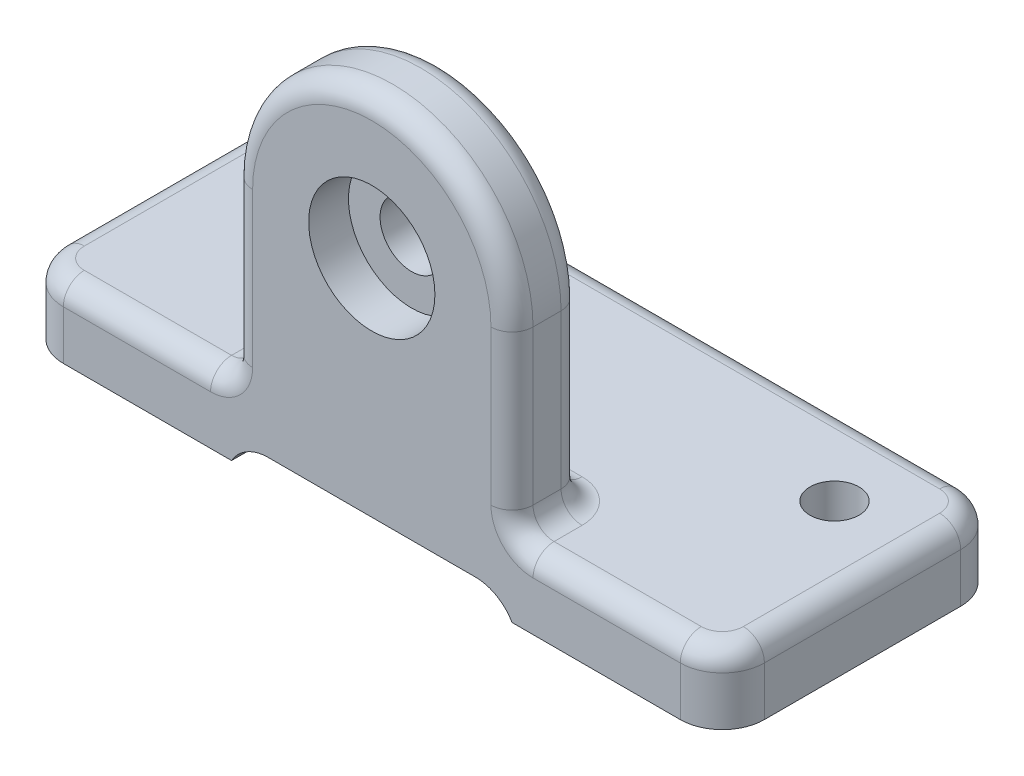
ISO-10303-21;
HEADER;
FILE_DESCRIPTION(('STEP AP214'),'2;1');
FILE_NAME('part.step','',(''),(''),'','','');
FILE_SCHEMA(('AUTOMOTIVE_DESIGN { 1 0 10303 214 1 1 1 1 }'));
ENDSEC;
DATA;
#1=APPLICATION_CONTEXT('core data for automotive mechanical design processes');
#2=APPLICATION_PROTOCOL_DEFINITION('international standard','automotive_design',2000,#1);
#3=PRODUCT_CONTEXT('',#1,'mechanical');
#4=PRODUCT('Part','Part','',(#3));
#5=PRODUCT_RELATED_PRODUCT_CATEGORY('part','',(#4));
#6=PRODUCT_DEFINITION_FORMATION('','',#4);
#7=PRODUCT_DEFINITION_CONTEXT('part definition',#1,'design');
#8=PRODUCT_DEFINITION('design','',#6,#7);
#9=PRODUCT_DEFINITION_SHAPE('','',#8);
#10=(LENGTH_UNIT() NAMED_UNIT(*) SI_UNIT(.MILLI.,.METRE.));
#11=(NAMED_UNIT(*) PLANE_ANGLE_UNIT() SI_UNIT($,.RADIAN.));
#12=(NAMED_UNIT(*) SI_UNIT($,.STERADIAN.) SOLID_ANGLE_UNIT());
#13=UNCERTAINTY_MEASURE_WITH_UNIT(LENGTH_MEASURE(1.E-05),#10,'distance_accuracy_value','');
#14=(GEOMETRIC_REPRESENTATION_CONTEXT(3) GLOBAL_UNCERTAINTY_ASSIGNED_CONTEXT((#13)) GLOBAL_UNIT_ASSIGNED_CONTEXT((#10,
#11,#12)) REPRESENTATION_CONTEXT('',''));
#15=CARTESIAN_POINT('',(0.,0.,0.));
#16=DIRECTION('',(0.,0.,1.));
#17=DIRECTION('',(1.,0.,0.));
#18=AXIS2_PLACEMENT_3D('',#15,#16,#17);
#19=CARTESIAN_POINT('',(0.,0.,-40.));
#20=DIRECTION('',(0.,-1.,0.));
#21=DIRECTION('',(0.,0.,-1.));
#22=AXIS2_PLACEMENT_3D('',#19,#20,#21);
#23=PLANE('',#22);
#24=CARTESIAN_POINT('',(12.,0.,-28.));
#25=DIRECTION('',(0.,1.,0.));
#26=DIRECTION('',(0.,0.,1.));
#27=AXIS2_PLACEMENT_3D('',#24,#25,#26);
#28=CIRCLE('',#27,3.5);
#29=CARTESIAN_POINT('',(12.,0.,-24.5));
#30=VERTEX_POINT('',#29);
#31=EDGE_CURVE('E489',#30,#30,#28,.T.);
#32=ORIENTED_EDGE('',*,*,#31,.T.);
#33=EDGE_LOOP('',(#32));
#34=FACE_BOUND('',#33,.T.);
#35=DIRECTION('',(1.,0.,0.));
#36=VECTOR('',#35,1.);
#37=CARTESIAN_POINT('',(0.,0.,0.));
#38=LINE('',#37,#36);
#39=CARTESIAN_POINT('',(6.,0.,0.));
#40=VERTEX_POINT('',#39);
#41=CARTESIAN_POINT('',(30.,0.,0.));
#42=VERTEX_POINT('',#41);
#43=EDGE_CURVE('E275',#40,#42,#38,.T.);
#44=ORIENTED_EDGE('',*,*,#43,.F.);
#45=CARTESIAN_POINT('',(6.,0.,-6.));
#46=DIRECTION('',(0.,-1.,0.));
#47=DIRECTION('',(0.,0.,-1.));
#48=AXIS2_PLACEMENT_3D('',#45,#46,#47);
#49=CIRCLE('',#48,6.);
#50=CARTESIAN_POINT('',(0.,0.,-6.));
#51=VERTEX_POINT('',#50);
#52=EDGE_CURVE('E292',#40,#51,#49,.T.);
#53=ORIENTED_EDGE('',*,*,#52,.T.);
#54=DIRECTION('',(0.,0.,1.));
#55=VECTOR('',#54,1.);
#56=CARTESIAN_POINT('',(0.,0.,0.));
#57=LINE('',#56,#55);
#58=CARTESIAN_POINT('',(0.,0.,-34.));
#59=VERTEX_POINT('',#58);
#60=EDGE_CURVE('E270',#59,#51,#57,.T.);
#61=ORIENTED_EDGE('',*,*,#60,.F.);
#62=CARTESIAN_POINT('',(6.,0.,-34.));
#63=DIRECTION('',(0.,-1.,0.));
#64=DIRECTION('',(0.,0.,-1.));
#65=AXIS2_PLACEMENT_3D('',#62,#63,#64);
#66=CIRCLE('',#65,6.);
#67=CARTESIAN_POINT('',(6.,0.,-40.));
#68=VERTEX_POINT('',#67);
#69=EDGE_CURVE('E248',#59,#68,#66,.T.);
#70=ORIENTED_EDGE('',*,*,#69,.T.);
#71=DIRECTION('',(-1.,0.,0.));
#72=VECTOR('',#71,1.);
#73=CARTESIAN_POINT('',(0.,0.,-40.));
#74=LINE('',#73,#72);
#75=CARTESIAN_POINT('',(30.,0.,-40.));
#76=VERTEX_POINT('',#75);
#77=EDGE_CURVE('E231',#76,#68,#74,.T.);
#78=ORIENTED_EDGE('',*,*,#77,.F.);
#79=DIRECTION('',(0.,0.,1.));
#80=VECTOR('',#79,1.);
#81=CARTESIAN_POINT('',(30.,0.,-40.));
#82=LINE('',#81,#80);
#83=EDGE_CURVE('E246',#76,#42,#82,.T.);
#84=ORIENTED_EDGE('',*,*,#83,.T.);
#85=EDGE_LOOP('',(#44,#53,#61,#70,#78,#84));
#86=FACE_BOUND('',#85,.T.);
#87=ADVANCED_FACE('F43',(#34,#86),#23,.T.);
#88=CARTESIAN_POINT('',(0.,10.,0.));
#89=DIRECTION('',(1.,0.,0.));
#90=DIRECTION('',(0.,0.,-1.));
#91=AXIS2_PLACEMENT_3D('',#88,#89,#90);
#92=PLANE('',#91);
#93=DIRECTION('',(0.,-1.,0.));
#94=VECTOR('',#93,1.);
#95=CARTESIAN_POINT('',(0.,10.,-6.));
#96=LINE('',#95,#94);
#97=CARTESIAN_POINT('',(0.,7.,-6.));
#98=VERTEX_POINT('',#97);
#99=EDGE_CURVE('E298',#51,#98,#96,.F.);
#100=ORIENTED_EDGE('',*,*,#99,.T.);
#101=DIRECTION('',(0.,0.,1.));
#102=VECTOR('',#101,1.);
#103=CARTESIAN_POINT('',(0.,7.,0.));
#104=LINE('',#103,#102);
#105=CARTESIAN_POINT('',(0.,7.,-34.));
#106=VERTEX_POINT('',#105);
#107=EDGE_CURVE('E346',#98,#106,#104,.F.);
#108=ORIENTED_EDGE('',*,*,#107,.T.);
#109=DIRECTION('',(0.,-1.,0.));
#110=VECTOR('',#109,1.);
#111=CARTESIAN_POINT('',(0.,10.,-34.));
#112=LINE('',#111,#110);
#113=EDGE_CURVE('E295',#106,#59,#112,.T.);
#114=ORIENTED_EDGE('',*,*,#113,.T.);
#115=ORIENTED_EDGE('',*,*,#60,.T.);
#116=EDGE_LOOP('',(#100,#108,#114,#115));
#117=FACE_BOUND('',#116,.T.);
#118=ADVANCED_FACE('F506',(#117),#92,.F.);
#119=CARTESIAN_POINT('',(0.,10.,0.));
#120=DIRECTION('',(0.,0.,-1.));
#121=DIRECTION('',(-1.,0.,0.));
#122=AXIS2_PLACEMENT_3D('',#119,#120,#121);
#123=PLANE('',#122);
#124=CARTESIAN_POINT('',(50.,35.,0.));
#125=DIRECTION('',(0.,0.,1.));
#126=DIRECTION('',(1.,0.,0.));
#127=AXIS2_PLACEMENT_3D('',#124,#125,#126);
#128=CIRCLE('',#127,9.005);
#129=CARTESIAN_POINT('',(59.005,35.,0.));
#130=VERTEX_POINT('',#129);
#131=EDGE_CURVE('E282',#130,#130,#128,.T.);
#132=ORIENTED_EDGE('',*,*,#131,.F.);
#133=EDGE_LOOP('',(#132));
#134=FACE_BOUND('',#133,.T.);
#135=CARTESIAN_POINT('',(27.,13.,0.));
#136=DIRECTION('',(0.,0.,-1.));
#137=DIRECTION('',(-1.,0.,0.));
#138=AXIS2_PLACEMENT_3D('',#135,#136,#137);
#139=CIRCLE('',#138,6.);
#140=CARTESIAN_POINT('',(27.,7.,0.));
#141=VERTEX_POINT('',#140);
#142=CARTESIAN_POINT('',(33.,13.,0.));
#143=VERTEX_POINT('',#142);
#144=EDGE_CURVE('E367',#141,#143,#139,.F.);
#145=ORIENTED_EDGE('',*,*,#144,.F.);
#146=DIRECTION('',(1.,0.,0.));
#147=VECTOR('',#146,1.);
#148=CARTESIAN_POINT('',(0.,7.,0.));
#149=LINE('',#148,#147);
#150=CARTESIAN_POINT('',(6.,7.,0.));
#151=VERTEX_POINT('',#150);
#152=EDGE_CURVE('E375',#141,#151,#149,.F.);
#153=ORIENTED_EDGE('',*,*,#152,.T.);
#154=DIRECTION('',(0.,-1.,0.));
#155=VECTOR('',#154,1.);
#156=CARTESIAN_POINT('',(6.,10.,0.));
#157=LINE('',#156,#155);
#158=EDGE_CURVE('E286',#151,#40,#157,.T.);
#159=ORIENTED_EDGE('',*,*,#158,.T.);
#160=ORIENTED_EDGE('',*,*,#43,.T.);
#161=CARTESIAN_POINT('',(35.1961524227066,-3.,0.));
#162=DIRECTION('',(0.,0.,-1.));
#163=DIRECTION('',(-1.,0.,0.));
#164=AXIS2_PLACEMENT_3D('',#161,#162,#163);
#165=CIRCLE('',#164,6.);
#166=CARTESIAN_POINT('',(35.1961524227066,3.,0.));
#167=VERTEX_POINT('',#166);
#168=EDGE_CURVE('E241',#42,#167,#165,.T.);
#169=ORIENTED_EDGE('',*,*,#168,.T.);
#170=DIRECTION('',(-1.,0.,0.));
#171=VECTOR('',#170,1.);
#172=CARTESIAN_POINT('',(30.,3.,0.));
#173=LINE('',#172,#171);
#174=CARTESIAN_POINT('',(64.8038475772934,3.,0.));
#175=VERTEX_POINT('',#174);
#176=EDGE_CURVE('E257',#175,#167,#173,.T.);
#177=ORIENTED_EDGE('',*,*,#176,.F.);
#178=CARTESIAN_POINT('',(64.8038475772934,-3.,0.));
#179=DIRECTION('',(0.,0.,-1.));
#180=DIRECTION('',(-1.,0.,0.));
#181=AXIS2_PLACEMENT_3D('',#178,#179,#180);
#182=CIRCLE('',#181,6.);
#183=CARTESIAN_POINT('',(70.,0.,0.));
#184=VERTEX_POINT('',#183);
#185=EDGE_CURVE('E315',#175,#184,#182,.T.);
#186=ORIENTED_EDGE('',*,*,#185,.T.);
#187=CARTESIAN_POINT('',(94.,0.,0.));
#188=VERTEX_POINT('',#187);
#189=EDGE_CURVE('E272',#184,#188,#38,.T.);
#190=ORIENTED_EDGE('',*,*,#189,.T.);
#191=DIRECTION('',(0.,-1.,0.));
#192=VECTOR('',#191,1.);
#193=CARTESIAN_POINT('',(94.,10.,0.));
#194=LINE('',#193,#192);
#195=CARTESIAN_POINT('',(94.,7.,0.));
#196=VERTEX_POINT('',#195);
#197=EDGE_CURVE('E287',#188,#196,#194,.F.);
#198=ORIENTED_EDGE('',*,*,#197,.T.);
#199=DIRECTION('',(1.,0.,0.));
#200=VECTOR('',#199,1.);
#201=CARTESIAN_POINT('',(0.,7.,0.));
#202=LINE('',#201,#200);
#203=CARTESIAN_POINT('',(73.,7.,0.));
#204=VERTEX_POINT('',#203);
#205=EDGE_CURVE('E370',#196,#204,#202,.F.);
#206=ORIENTED_EDGE('',*,*,#205,.T.);
#207=CARTESIAN_POINT('',(73.,13.,0.));
#208=DIRECTION('',(0.,0.,-1.));
#209=DIRECTION('',(-1.,0.,0.));
#210=AXIS2_PLACEMENT_3D('',#207,#208,#209);
#211=CIRCLE('',#210,6.);
#212=CARTESIAN_POINT('',(67.,13.,0.));
#213=VERTEX_POINT('',#212);
#214=EDGE_CURVE('E364',#213,#204,#211,.F.);
#215=ORIENTED_EDGE('',*,*,#214,.F.);
#216=DIRECTION('',(0.,1.,0.));
#217=VECTOR('',#216,1.);
#218=CARTESIAN_POINT('',(67.,35.,0.));
#219=LINE('',#218,#217);
#220=CARTESIAN_POINT('',(67.,35.,0.));
#221=VERTEX_POINT('',#220);
#222=EDGE_CURVE('E365',#213,#221,#219,.T.);
#223=ORIENTED_EDGE('',*,*,#222,.T.);
#224=CARTESIAN_POINT('',(50.,35.,0.));
#225=DIRECTION('',(0.,0.,-1.));
#226=DIRECTION('',(-1.,0.,0.));
#227=AXIS2_PLACEMENT_3D('',#224,#225,#226);
#228=CIRCLE('',#227,17.);
#229=CARTESIAN_POINT('',(33.,35.,0.));
#230=VERTEX_POINT('',#229);
#231=EDGE_CURVE('E356',#221,#230,#228,.F.);
#232=ORIENTED_EDGE('',*,*,#231,.T.);
#233=DIRECTION('',(0.,-1.,0.));
#234=VECTOR('',#233,1.);
#235=CARTESIAN_POINT('',(33.,10.,0.));
#236=LINE('',#235,#234);
#237=EDGE_CURVE('E359',#230,#143,#236,.T.);
#238=ORIENTED_EDGE('',*,*,#237,.T.);
#239=EDGE_LOOP('',(#145,#153,#159,#160,#169,#177,#186,#190,#198,#206,#215,#223,#232,#238));
#240=FACE_BOUND('',#239,.T.);
#241=ADVANCED_FACE('F498',(#134,#240),#123,.F.);
#242=CARTESIAN_POINT('',(100.,10.,0.));
#243=DIRECTION('',(-1.,0.,0.));
#244=DIRECTION('',(0.,0.,1.));
#245=AXIS2_PLACEMENT_3D('',#242,#243,#244);
#246=PLANE('',#245);
#247=DIRECTION('',(0.,-1.,0.));
#248=VECTOR('',#247,1.);
#249=CARTESIAN_POINT('',(100.,10.,-34.));
#250=LINE('',#249,#248);
#251=CARTESIAN_POINT('',(100.,0.,-34.));
#252=VERTEX_POINT('',#251);
#253=CARTESIAN_POINT('',(100.,7.,-34.));
#254=VERTEX_POINT('',#253);
#255=EDGE_CURVE('E307',#252,#254,#250,.F.);
#256=ORIENTED_EDGE('',*,*,#255,.T.);
#257=DIRECTION('',(0.,0.,-1.));
#258=VECTOR('',#257,1.);
#259=CARTESIAN_POINT('',(100.,7.,0.));
#260=LINE('',#259,#258);
#261=CARTESIAN_POINT('',(100.,7.,-6.));
#262=VERTEX_POINT('',#261);
#263=EDGE_CURVE('E372',#254,#262,#260,.F.);
#264=ORIENTED_EDGE('',*,*,#263,.T.);
#265=DIRECTION('',(0.,-1.,0.));
#266=VECTOR('',#265,1.);
#267=CARTESIAN_POINT('',(100.,10.,-6.));
#268=LINE('',#267,#266);
#269=CARTESIAN_POINT('',(100.,0.,-6.));
#270=VERTEX_POINT('',#269);
#271=EDGE_CURVE('E310',#262,#270,#268,.T.);
#272=ORIENTED_EDGE('',*,*,#271,.T.);
#273=DIRECTION('',(0.,0.,-1.));
#274=VECTOR('',#273,1.);
#275=CARTESIAN_POINT('',(100.,0.,0.));
#276=LINE('',#275,#274);
#277=EDGE_CURVE('E252',#270,#252,#276,.T.);
#278=ORIENTED_EDGE('',*,*,#277,.T.);
#279=EDGE_LOOP('',(#256,#264,#272,#278));
#280=FACE_BOUND('',#279,.T.);
#281=ADVANCED_FACE('F548',(#280),#246,.F.);
#282=CARTESIAN_POINT('',(0.,10.,-40.));
#283=DIRECTION('',(0.,0.,1.));
#284=DIRECTION('',(1.,0.,0.));
#285=AXIS2_PLACEMENT_3D('',#282,#283,#284);
#286=PLANE('',#285);
#287=DIRECTION('',(0.,-1.,0.));
#288=VECTOR('',#287,1.);
#289=CARTESIAN_POINT('',(6.,10.,-40.));
#290=LINE('',#289,#288);
#291=CARTESIAN_POINT('',(6.,7.,-40.));
#292=VERTEX_POINT('',#291);
#293=EDGE_CURVE('E301',#68,#292,#290,.F.);
#294=ORIENTED_EDGE('',*,*,#293,.T.);
#295=DIRECTION('',(-1.,0.,0.));
#296=VECTOR('',#295,1.);
#297=CARTESIAN_POINT('',(0.,7.,-40.));
#298=LINE('',#297,#296);
#299=CARTESIAN_POINT('',(94.,7.,-40.));
#300=VERTEX_POINT('',#299);
#301=EDGE_CURVE('E354',#292,#300,#298,.F.);
#302=ORIENTED_EDGE('',*,*,#301,.T.);
#303=DIRECTION('',(0.,-1.,0.));
#304=VECTOR('',#303,1.);
#305=CARTESIAN_POINT('',(94.,10.,-40.));
#306=LINE('',#305,#304);
#307=CARTESIAN_POINT('',(94.,0.,-40.));
#308=VERTEX_POINT('',#307);
#309=EDGE_CURVE('E299',#300,#308,#306,.T.);
#310=ORIENTED_EDGE('',*,*,#309,.T.);
#311=CARTESIAN_POINT('',(70.,0.,-40.));
#312=VERTEX_POINT('',#311);
#313=EDGE_CURVE('E249',#308,#312,#74,.T.);
#314=ORIENTED_EDGE('',*,*,#313,.T.);
#315=CARTESIAN_POINT('',(64.8038475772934,-3.,-40.));
#316=DIRECTION('',(0.,0.,1.));
#317=DIRECTION('',(1.,0.,0.));
#318=AXIS2_PLACEMENT_3D('',#315,#316,#317);
#319=CIRCLE('',#318,6.);
#320=CARTESIAN_POINT('',(64.8038475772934,3.,-40.));
#321=VERTEX_POINT('',#320);
#322=EDGE_CURVE('E313',#312,#321,#319,.T.);
#323=ORIENTED_EDGE('',*,*,#322,.T.);
#324=DIRECTION('',(-1.,0.,0.));
#325=VECTOR('',#324,1.);
#326=CARTESIAN_POINT('',(30.,3.,-40.));
#327=LINE('',#326,#325);
#328=CARTESIAN_POINT('',(35.1961524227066,3.,-40.));
#329=VERTEX_POINT('',#328);
#330=EDGE_CURVE('E236',#321,#329,#327,.T.);
#331=ORIENTED_EDGE('',*,*,#330,.T.);
#332=CARTESIAN_POINT('',(35.1961524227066,-3.,-40.));
#333=DIRECTION('',(0.,0.,1.));
#334=DIRECTION('',(1.,0.,0.));
#335=AXIS2_PLACEMENT_3D('',#332,#333,#334);
#336=CIRCLE('',#335,6.);
#337=EDGE_CURVE('E230',#329,#76,#336,.T.);
#338=ORIENTED_EDGE('',*,*,#337,.T.);
#339=ORIENTED_EDGE('',*,*,#77,.T.);
#340=EDGE_LOOP('',(#294,#302,#310,#314,#323,#331,#338,#339));
#341=FACE_BOUND('',#340,.T.);
#342=ADVANCED_FACE('F235',(#341),#286,.F.);
#343=CARTESIAN_POINT('',(0.,10.,-40.));
#344=DIRECTION('',(0.,-1.,0.));
#345=DIRECTION('',(0.,0.,-1.));
#346=AXIS2_PLACEMENT_3D('',#343,#344,#345);
#347=PLANE('',#346);
#348=DIRECTION('',(-1.,0.,0.));
#349=VECTOR('',#348,1.);
#350=CARTESIAN_POINT('',(0.,10.,-37.));
#351=LINE('',#350,#349);
#352=CARTESIAN_POINT('',(94.,10.,-37.));
#353=VERTEX_POINT('',#352);
#354=CARTESIAN_POINT('',(6.,10.,-37.));
#355=VERTEX_POINT('',#354);
#356=EDGE_CURVE('E338',#353,#355,#351,.T.);
#357=ORIENTED_EDGE('',*,*,#356,.T.);
#358=CARTESIAN_POINT('',(6.,10.,-34.));
#359=DIRECTION('',(0.,-1.,0.));
#360=DIRECTION('',(0.,0.,-1.));
#361=AXIS2_PLACEMENT_3D('',#358,#359,#360);
#362=CIRCLE('',#361,3.);
#363=CARTESIAN_POINT('',(3.,10.,-34.));
#364=VERTEX_POINT('',#363);
#365=EDGE_CURVE('E341',#355,#364,#362,.F.);
#366=ORIENTED_EDGE('',*,*,#365,.T.);
#367=DIRECTION('',(0.,0.,1.));
#368=VECTOR('',#367,1.);
#369=CARTESIAN_POINT('',(3.,10.,-40.));
#370=LINE('',#369,#368);
#371=CARTESIAN_POINT('',(3.,10.,-6.));
#372=VERTEX_POINT('',#371);
#373=EDGE_CURVE('E345',#364,#372,#370,.T.);
#374=ORIENTED_EDGE('',*,*,#373,.T.);
#375=CARTESIAN_POINT('',(6.,10.,-6.));
#376=DIRECTION('',(0.,-1.,0.));
#377=DIRECTION('',(0.,0.,-1.));
#378=AXIS2_PLACEMENT_3D('',#375,#376,#377);
#379=CIRCLE('',#378,3.);
#380=CARTESIAN_POINT('',(6.,10.,-3.));
#381=VERTEX_POINT('',#380);
#382=EDGE_CURVE('E336',#372,#381,#379,.F.);
#383=ORIENTED_EDGE('',*,*,#382,.T.);
#384=DIRECTION('',(1.,0.,0.));
#385=VECTOR('',#384,1.);
#386=CARTESIAN_POINT('',(0.,10.,-3.));
#387=LINE('',#386,#385);
#388=CARTESIAN_POINT('',(27.,10.,-3.));
#389=VERTEX_POINT('',#388);
#390=EDGE_CURVE('E331',#381,#389,#387,.T.);
#391=ORIENTED_EDGE('',*,*,#390,.T.);
#392=DIRECTION('',(0.,0.,-1.));
#393=VECTOR('',#392,1.);
#394=CARTESIAN_POINT('',(27.,10.,-40.));
#395=LINE('',#394,#393);
#396=CARTESIAN_POINT('',(27.,10.,-7.));
#397=VERTEX_POINT('',#396);
#398=EDGE_CURVE('E328',#389,#397,#395,.T.);
#399=ORIENTED_EDGE('',*,*,#398,.T.);
#400=CARTESIAN_POINT('',(33.,10.,-7.));
#401=DIRECTION('',(0.,-1.,0.));
#402=DIRECTION('',(0.,0.,-1.));
#403=AXIS2_PLACEMENT_3D('',#400,#401,#402);
#404=CIRCLE('',#403,6.);
#405=CARTESIAN_POINT('',(33.,10.,-13.));
#406=VERTEX_POINT('',#405);
#407=EDGE_CURVE('E330',#406,#397,#404,.F.);
#408=ORIENTED_EDGE('',*,*,#407,.F.);
#409=DIRECTION('',(1.,0.,0.));
#410=VECTOR('',#409,1.);
#411=CARTESIAN_POINT('',(0.,10.,-13.));
#412=LINE('',#411,#410);
#413=CARTESIAN_POINT('',(67.,10.,-13.));
#414=VERTEX_POINT('',#413);
#415=EDGE_CURVE('E325',#406,#414,#412,.T.);
#416=ORIENTED_EDGE('',*,*,#415,.T.);
#417=CARTESIAN_POINT('',(67.,10.,-7.));
#418=DIRECTION('',(0.,-1.,0.));
#419=DIRECTION('',(0.,0.,-1.));
#420=AXIS2_PLACEMENT_3D('',#417,#418,#419);
#421=CIRCLE('',#420,6.);
#422=CARTESIAN_POINT('',(73.,10.,-7.));
#423=VERTEX_POINT('',#422);
#424=EDGE_CURVE('E318',#423,#414,#421,.F.);
#425=ORIENTED_EDGE('',*,*,#424,.F.);
#426=DIRECTION('',(0.,0.,1.));
#427=VECTOR('',#426,1.);
#428=CARTESIAN_POINT('',(73.,10.,-40.));
#429=LINE('',#428,#427);
#430=CARTESIAN_POINT('',(73.,10.,-3.));
#431=VERTEX_POINT('',#430);
#432=EDGE_CURVE('E239',#423,#431,#429,.T.);
#433=ORIENTED_EDGE('',*,*,#432,.T.);
#434=DIRECTION('',(1.,0.,0.));
#435=VECTOR('',#434,1.);
#436=CARTESIAN_POINT('',(0.,10.,-3.));
#437=LINE('',#436,#435);
#438=CARTESIAN_POINT('',(94.,10.,-3.));
#439=VERTEX_POINT('',#438);
#440=EDGE_CURVE('E319',#431,#439,#437,.T.);
#441=ORIENTED_EDGE('',*,*,#440,.T.);
#442=CARTESIAN_POINT('',(94.,10.,-6.));
#443=DIRECTION('',(0.,-1.,0.));
#444=DIRECTION('',(0.,0.,-1.));
#445=AXIS2_PLACEMENT_3D('',#442,#443,#444);
#446=CIRCLE('',#445,3.);
#447=CARTESIAN_POINT('',(97.,10.,-6.));
#448=VERTEX_POINT('',#447);
#449=EDGE_CURVE('E322',#439,#448,#446,.F.);
#450=ORIENTED_EDGE('',*,*,#449,.T.);
#451=DIRECTION('',(0.,0.,-1.));
#452=VECTOR('',#451,1.);
#453=CARTESIAN_POINT('',(97.,10.,-40.));
#454=LINE('',#453,#452);
#455=CARTESIAN_POINT('',(97.,10.,-34.));
#456=VERTEX_POINT('',#455);
#457=EDGE_CURVE('E335',#448,#456,#454,.T.);
#458=ORIENTED_EDGE('',*,*,#457,.T.);
#459=CARTESIAN_POINT('',(94.,10.,-34.));
#460=DIRECTION('',(0.,-1.,0.));
#461=DIRECTION('',(0.,0.,-1.));
#462=AXIS2_PLACEMENT_3D('',#459,#460,#461);
#463=CIRCLE('',#462,3.);
#464=EDGE_CURVE('E337',#456,#353,#463,.F.);
#465=ORIENTED_EDGE('',*,*,#464,.T.);
#466=EDGE_LOOP('',(#357,#366,#374,#383,#391,#399,#408,#416,#425,#433,#441,#450,#458,#465));
#467=FACE_BOUND('',#466,.T.);
#468=CARTESIAN_POINT('',(88.,10.,-28.));
#469=DIRECTION('',(0.,1.,0.));
#470=DIRECTION('',(0.,0.,1.));
#471=AXIS2_PLACEMENT_3D('',#468,#469,#470);
#472=CIRCLE('',#471,3.49999999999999);
#473=CARTESIAN_POINT('',(88.,10.,-24.5));
#474=VERTEX_POINT('',#473);
#475=EDGE_CURVE('E278',#474,#474,#472,.T.);
#476=ORIENTED_EDGE('',*,*,#475,.F.);
#477=EDGE_LOOP('',(#476));
#478=FACE_BOUND('',#477,.T.);
#479=CARTESIAN_POINT('',(12.,10.,-28.));
#480=DIRECTION('',(0.,1.,0.));
#481=DIRECTION('',(0.,0.,1.));
#482=AXIS2_PLACEMENT_3D('',#479,#480,#481);
#483=CIRCLE('',#482,3.49999999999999);
#484=CARTESIAN_POINT('',(12.,10.,-24.5));
#485=VERTEX_POINT('',#484);
#486=EDGE_CURVE('E487',#485,#485,#483,.T.);
#487=ORIENTED_EDGE('',*,*,#486,.F.);
#488=EDGE_LOOP('',(#487));
#489=FACE_BOUND('',#488,.T.);
#490=ADVANCED_FACE('F591',(#467,#478,#489),#347,.F.);
#491=CARTESIAN_POINT('',(88.,0.,-28.));
#492=DIRECTION('',(0.,1.,0.));
#493=DIRECTION('',(0.,0.,1.));
#494=AXIS2_PLACEMENT_3D('',#491,#492,#493);
#495=CIRCLE('',#494,3.5);
#496=CARTESIAN_POINT('',(88.,0.,-24.5));
#497=VERTEX_POINT('',#496);
#498=EDGE_CURVE('E481',#497,#497,#495,.T.);
#499=ORIENTED_EDGE('',*,*,#498,.T.);
#500=EDGE_LOOP('',(#499));
#501=FACE_BOUND('',#500,.T.);
#502=ORIENTED_EDGE('',*,*,#313,.F.);
#503=CARTESIAN_POINT('',(94.,0.,-34.));
#504=DIRECTION('',(0.,-1.,0.));
#505=DIRECTION('',(0.,0.,-1.));
#506=AXIS2_PLACEMENT_3D('',#503,#504,#505);
#507=CIRCLE('',#506,6.);
#508=EDGE_CURVE('E304',#308,#252,#507,.T.);
#509=ORIENTED_EDGE('',*,*,#508,.T.);
#510=ORIENTED_EDGE('',*,*,#277,.F.);
#511=CARTESIAN_POINT('',(94.,0.,-6.));
#512=DIRECTION('',(0.,-1.,0.));
#513=DIRECTION('',(0.,0.,-1.));
#514=AXIS2_PLACEMENT_3D('',#511,#512,#513);
#515=CIRCLE('',#514,6.);
#516=EDGE_CURVE('E303',#270,#188,#515,.T.);
#517=ORIENTED_EDGE('',*,*,#516,.T.);
#518=ORIENTED_EDGE('',*,*,#189,.F.);
#519=DIRECTION('',(0.,0.,1.));
#520=VECTOR('',#519,1.);
#521=CARTESIAN_POINT('',(70.,0.,-40.));
#522=LINE('',#521,#520);
#523=EDGE_CURVE('E253',#312,#184,#522,.T.);
#524=ORIENTED_EDGE('',*,*,#523,.F.);
#525=EDGE_LOOP('',(#502,#509,#510,#517,#518,#524));
#526=FACE_BOUND('',#525,.T.);
#527=ADVANCED_FACE('F626',(#501,#526),#23,.T.);
#528=CARTESIAN_POINT('',(30.,0.,-10.));
#529=DIRECTION('',(-1.,0.,0.));
#530=DIRECTION('',(0.,-1.,0.));
#531=AXIS2_PLACEMENT_3D('',#528,#529,#530);
#532=PLANE('',#531);
#533=DIRECTION('',(0.,0.,1.));
#534=VECTOR('',#533,1.);
#535=CARTESIAN_POINT('',(30.,35.,-10.));
#536=LINE('',#535,#534);
#537=CARTESIAN_POINT('',(30.,35.,-7.));
#538=VERTEX_POINT('',#537);
#539=CARTESIAN_POINT('',(30.,35.,-3.));
#540=VERTEX_POINT('',#539);
#541=EDGE_CURVE('E261',#538,#540,#536,.T.);
#542=ORIENTED_EDGE('',*,*,#541,.F.);
#543=DIRECTION('',(0.,-1.,0.));
#544=VECTOR('',#543,1.);
#545=CARTESIAN_POINT('',(30.,0.,-7.));
#546=LINE('',#545,#544);
#547=CARTESIAN_POINT('',(30.,13.,-7.));
#548=VERTEX_POINT('',#547);
#549=EDGE_CURVE('E382',#538,#548,#546,.T.);
#550=ORIENTED_EDGE('',*,*,#549,.T.);
#551=DIRECTION('',(0.,0.,-1.));
#552=VECTOR('',#551,1.);
#553=CARTESIAN_POINT('',(30.,13.,-10.));
#554=LINE('',#553,#552);
#555=CARTESIAN_POINT('',(30.,13.,-3.));
#556=VERTEX_POINT('',#555);
#557=EDGE_CURVE('E377',#548,#556,#554,.F.);
#558=ORIENTED_EDGE('',*,*,#557,.T.);
#559=DIRECTION('',(0.,-1.,0.));
#560=VECTOR('',#559,1.);
#561=CARTESIAN_POINT('',(30.,35.,-3.));
#562=LINE('',#561,#560);
#563=EDGE_CURVE('E376',#556,#540,#562,.F.);
#564=ORIENTED_EDGE('',*,*,#563,.T.);
#565=EDGE_LOOP('',(#542,#550,#558,#564));
#566=FACE_BOUND('',#565,.T.);
#567=ADVANCED_FACE('F634',(#566),#532,.T.);
#568=CARTESIAN_POINT('',(70.,35.,-10.));
#569=DIRECTION('',(1.,0.,0.));
#570=DIRECTION('',(0.,0.,-1.));
#571=AXIS2_PLACEMENT_3D('',#568,#569,#570);
#572=PLANE('',#571);
#573=DIRECTION('',(0.,0.,1.));
#574=VECTOR('',#573,1.);
#575=CARTESIAN_POINT('',(70.,13.,-10.));
#576=LINE('',#575,#574);
#577=CARTESIAN_POINT('',(70.,13.,-3.));
#578=VERTEX_POINT('',#577);
#579=CARTESIAN_POINT('',(70.,13.,-7.));
#580=VERTEX_POINT('',#579);
#581=EDGE_CURVE('E58',#578,#580,#576,.F.);
#582=ORIENTED_EDGE('',*,*,#581,.T.);
#583=DIRECTION('',(0.,1.,0.));
#584=VECTOR('',#583,1.);
#585=CARTESIAN_POINT('',(70.,35.,-7.));
#586=LINE('',#585,#584);
#587=CARTESIAN_POINT('',(70.,35.,-7.));
#588=VERTEX_POINT('',#587);
#589=EDGE_CURVE('E397',#580,#588,#586,.T.);
#590=ORIENTED_EDGE('',*,*,#589,.T.);
#591=DIRECTION('',(0.,0.,1.));
#592=VECTOR('',#591,1.);
#593=CARTESIAN_POINT('',(70.,35.,-10.));
#594=LINE('',#593,#592);
#595=CARTESIAN_POINT('',(70.,35.,-3.));
#596=VERTEX_POINT('',#595);
#597=EDGE_CURVE('E260',#588,#596,#594,.T.);
#598=ORIENTED_EDGE('',*,*,#597,.T.);
#599=DIRECTION('',(0.,1.,0.));
#600=VECTOR('',#599,1.);
#601=CARTESIAN_POINT('',(70.,10.,-3.));
#602=LINE('',#601,#600);
#603=EDGE_CURVE('E62',#596,#578,#602,.F.);
#604=ORIENTED_EDGE('',*,*,#603,.T.);
#605=EDGE_LOOP('',(#582,#590,#598,#604));
#606=FACE_BOUND('',#605,.T.);
#607=ADVANCED_FACE('F642',(#606),#572,.T.);
#608=CARTESIAN_POINT('',(50.,35.,-10.));
#609=DIRECTION('',(0.,0.,-1.));
#610=DIRECTION('',(-1.,0.,0.));
#611=AXIS2_PLACEMENT_3D('',#608,#609,#610);
#612=PLANE('',#611);
#613=DIRECTION('',(0.,1.,0.));
#614=VECTOR('',#613,1.);
#615=CARTESIAN_POINT('',(67.,35.,-10.));
#616=LINE('',#615,#614);
#617=CARTESIAN_POINT('',(67.,35.,-10.));
#618=VERTEX_POINT('',#617);
#619=CARTESIAN_POINT('',(67.,13.,-10.));
#620=VERTEX_POINT('',#619);
#621=EDGE_CURVE('E388',#618,#620,#616,.F.);
#622=ORIENTED_EDGE('',*,*,#621,.T.);
#623=DIRECTION('',(1.,0.,0.));
#624=VECTOR('',#623,1.);
#625=CARTESIAN_POINT('',(50.,13.,-10.));
#626=LINE('',#625,#624);
#627=CARTESIAN_POINT('',(33.,13.,-10.));
#628=VERTEX_POINT('',#627);
#629=EDGE_CURVE('E392',#620,#628,#626,.F.);
#630=ORIENTED_EDGE('',*,*,#629,.T.);
#631=DIRECTION('',(0.,-1.,0.));
#632=VECTOR('',#631,1.);
#633=CARTESIAN_POINT('',(33.,35.,-10.));
#634=LINE('',#633,#632);
#635=CARTESIAN_POINT('',(33.,35.,-10.));
#636=VERTEX_POINT('',#635);
#637=EDGE_CURVE('E386',#628,#636,#634,.F.);
#638=ORIENTED_EDGE('',*,*,#637,.T.);
#639=CARTESIAN_POINT('',(50.,35.,-10.));
#640=DIRECTION('',(0.,0.,-1.));
#641=DIRECTION('',(-1.,0.,0.));
#642=AXIS2_PLACEMENT_3D('',#639,#640,#641);
#643=CIRCLE('',#642,17.);
#644=EDGE_CURVE('E383',#636,#618,#643,.T.);
#645=ORIENTED_EDGE('',*,*,#644,.T.);
#646=EDGE_LOOP('',(#622,#630,#638,#645));
#647=FACE_BOUND('',#646,.T.);
#648=CARTESIAN_POINT('',(50.,35.,-10.));
#649=DIRECTION('',(0.,0.,-1.));
#650=DIRECTION('',(-1.,0.,0.));
#651=AXIS2_PLACEMENT_3D('',#648,#649,#650);
#652=CIRCLE('',#651,4.5);
#653=CARTESIAN_POINT('',(45.5,35.,-10.));
#654=VERTEX_POINT('',#653);
#655=EDGE_CURVE('E280',#654,#654,#652,.T.);
#656=ORIENTED_EDGE('',*,*,#655,.F.);
#657=EDGE_LOOP('',(#656));
#658=FACE_BOUND('',#657,.T.);
#659=ADVANCED_FACE('F714',(#647,#658),#612,.T.);
#660=CARTESIAN_POINT('',(50.,35.,-10.));
#661=DIRECTION('',(0.,0.,1.));
#662=DIRECTION('',(1.,0.,0.));
#663=AXIS2_PLACEMENT_3D('',#660,#661,#662);
#664=CYLINDRICAL_SURFACE('',#663,20.);
#665=ORIENTED_EDGE('',*,*,#597,.F.);
#666=CARTESIAN_POINT('',(50.,35.,-7.));
#667=DIRECTION('',(0.,0.,-1.));
#668=DIRECTION('',(-1.,0.,0.));
#669=AXIS2_PLACEMENT_3D('',#666,#667,#668);
#670=CIRCLE('',#669,20.);
#671=EDGE_CURVE('E11',#588,#538,#670,.F.);
#672=ORIENTED_EDGE('',*,*,#671,.T.);
#673=ORIENTED_EDGE('',*,*,#541,.T.);
#674=CARTESIAN_POINT('',(50.,35.,-3.));
#675=DIRECTION('',(0.,0.,-1.));
#676=DIRECTION('',(-1.,0.,0.));
#677=AXIS2_PLACEMENT_3D('',#674,#675,#676);
#678=CIRCLE('',#677,20.);
#679=EDGE_CURVE('E55',#540,#596,#678,.T.);
#680=ORIENTED_EDGE('',*,*,#679,.T.);
#681=EDGE_LOOP('',(#665,#672,#673,#680));
#682=FACE_BOUND('',#681,.T.);
#683=ADVANCED_FACE('F717',(#682),#664,.T.);
#684=CARTESIAN_POINT('',(30.,3.,-40.));
#685=DIRECTION('',(0.,1.,0.));
#686=DIRECTION('',(0.,0.,1.));
#687=AXIS2_PLACEMENT_3D('',#684,#685,#686);
#688=PLANE('',#687);
#689=ORIENTED_EDGE('',*,*,#330,.F.);
#690=DIRECTION('',(0.,0.,-1.));
#691=VECTOR('',#690,1.);
#692=CARTESIAN_POINT('',(64.8038475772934,3.,-40.));
#693=LINE('',#692,#691);
#694=EDGE_CURVE('E283',#321,#175,#693,.F.);
#695=ORIENTED_EDGE('',*,*,#694,.T.);
#696=ORIENTED_EDGE('',*,*,#176,.T.);
#697=DIRECTION('',(0.,0.,1.));
#698=VECTOR('',#697,1.);
#699=CARTESIAN_POINT('',(35.1961524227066,3.,-40.));
#700=LINE('',#699,#698);
#701=EDGE_CURVE('E277',#167,#329,#700,.F.);
#702=ORIENTED_EDGE('',*,*,#701,.T.);
#703=EDGE_LOOP('',(#689,#695,#696,#702));
#704=FACE_BOUND('',#703,.T.);
#705=ADVANCED_FACE('F492',(#704),#688,.F.);
#706=CARTESIAN_POINT('',(12.,10.,-28.));
#707=DIRECTION('',(0.,1.,0.));
#708=DIRECTION('',(0.,0.,1.));
#709=AXIS2_PLACEMENT_3D('',#706,#707,#708);
#710=CYLINDRICAL_SURFACE('',#709,3.49999999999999);
#711=ORIENTED_EDGE('',*,*,#31,.F.);
#712=EDGE_LOOP('',(#711));
#713=FACE_BOUND('',#712,.T.);
#714=ORIENTED_EDGE('',*,*,#486,.T.);
#715=EDGE_LOOP('',(#714));
#716=FACE_BOUND('',#715,.T.);
#717=ADVANCED_FACE('F724',(#713,#716),#710,.F.);
#718=CARTESIAN_POINT('',(88.,10.,-28.));
#719=DIRECTION('',(0.,1.,0.));
#720=DIRECTION('',(0.,0.,1.));
#721=AXIS2_PLACEMENT_3D('',#718,#719,#720);
#722=CYLINDRICAL_SURFACE('',#721,3.5);
#723=ORIENTED_EDGE('',*,*,#498,.F.);
#724=EDGE_LOOP('',(#723));
#725=FACE_BOUND('',#724,.T.);
#726=ORIENTED_EDGE('',*,*,#475,.T.);
#727=EDGE_LOOP('',(#726));
#728=FACE_BOUND('',#727,.T.);
#729=ADVANCED_FACE('F753',(#725,#728),#722,.F.);
#730=CARTESIAN_POINT('',(50.,35.,0.));
#731=DIRECTION('',(0.,0.,1.));
#732=DIRECTION('',(1.,0.,0.));
#733=AXIS2_PLACEMENT_3D('',#730,#731,#732);
#734=CYLINDRICAL_SURFACE('',#733,9.005);
#735=CARTESIAN_POINT('',(50.,35.,-5.68));
#736=DIRECTION('',(0.,0.,1.));
#737=DIRECTION('',(1.,0.,0.));
#738=AXIS2_PLACEMENT_3D('',#735,#736,#737);
#739=CIRCLE('',#738,9.005);
#740=CARTESIAN_POINT('',(59.005,35.,-5.68));
#741=VERTEX_POINT('',#740);
#742=EDGE_CURVE('E474',#741,#741,#739,.T.);
#743=ORIENTED_EDGE('',*,*,#742,.F.);
#744=EDGE_LOOP('',(#743));
#745=FACE_BOUND('',#744,.T.);
#746=ORIENTED_EDGE('',*,*,#131,.T.);
#747=EDGE_LOOP('',(#746));
#748=FACE_BOUND('',#747,.T.);
#749=ADVANCED_FACE('F757',(#745,#748),#734,.F.);
#750=CARTESIAN_POINT('',(54.5,35.,-5.68));
#751=DIRECTION('',(0.,0.,-1.));
#752=DIRECTION('',(-1.,0.,0.));
#753=AXIS2_PLACEMENT_3D('',#750,#751,#752);
#754=PLANE('',#753);
#755=CARTESIAN_POINT('',(50.,35.,-5.68));
#756=DIRECTION('',(0.,0.,1.));
#757=DIRECTION('',(1.,0.,0.));
#758=AXIS2_PLACEMENT_3D('',#755,#756,#757);
#759=CIRCLE('',#758,4.5);
#760=CARTESIAN_POINT('',(54.5,35.,-5.68));
#761=VERTEX_POINT('',#760);
#762=EDGE_CURVE('E470',#761,#761,#759,.T.);
#763=ORIENTED_EDGE('',*,*,#762,.F.);
#764=EDGE_LOOP('',(#763));
#765=FACE_BOUND('',#764,.T.);
#766=ORIENTED_EDGE('',*,*,#742,.T.);
#767=EDGE_LOOP('',(#766));
#768=FACE_BOUND('',#767,.T.);
#769=ADVANCED_FACE('F659',(#765,#768),#754,.F.);
#770=CARTESIAN_POINT('',(50.,35.,0.));
#771=DIRECTION('',(0.,0.,1.));
#772=DIRECTION('',(1.,0.,0.));
#773=AXIS2_PLACEMENT_3D('',#770,#771,#772);
#774=CYLINDRICAL_SURFACE('',#773,4.5);
#775=ORIENTED_EDGE('',*,*,#655,.T.);
#776=EDGE_LOOP('',(#775));
#777=FACE_BOUND('',#776,.T.);
#778=ORIENTED_EDGE('',*,*,#762,.T.);
#779=EDGE_LOOP('',(#778));
#780=FACE_BOUND('',#779,.T.);
#781=ADVANCED_FACE('F655',(#777,#780),#774,.F.);
#782=CARTESIAN_POINT('',(64.8038475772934,-3.,-40.));
#783=DIRECTION('',(0.,0.,-1.));
#784=DIRECTION('',(-1.,0.,0.));
#785=AXIS2_PLACEMENT_3D('',#782,#783,#784);
#786=CYLINDRICAL_SURFACE('',#785,6.);
#787=ORIENTED_EDGE('',*,*,#322,.F.);
#788=ORIENTED_EDGE('',*,*,#523,.T.);
#789=ORIENTED_EDGE('',*,*,#185,.F.);
#790=ORIENTED_EDGE('',*,*,#694,.F.);
#791=EDGE_LOOP('',(#787,#788,#789,#790));
#792=FACE_BOUND('',#791,.T.);
#793=ADVANCED_FACE('F647',(#792),#786,.F.);
#794=CARTESIAN_POINT('',(35.1961524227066,-3.,-40.));
#795=DIRECTION('',(0.,0.,1.));
#796=DIRECTION('',(1.,0.,0.));
#797=AXIS2_PLACEMENT_3D('',#794,#795,#796);
#798=CYLINDRICAL_SURFACE('',#797,6.);
#799=ORIENTED_EDGE('',*,*,#337,.F.);
#800=ORIENTED_EDGE('',*,*,#701,.F.);
#801=ORIENTED_EDGE('',*,*,#168,.F.);
#802=ORIENTED_EDGE('',*,*,#83,.F.);
#803=EDGE_LOOP('',(#799,#800,#801,#802));
#804=FACE_BOUND('',#803,.T.);
#805=ADVANCED_FACE('F254',(#804),#798,.F.);
#806=CARTESIAN_POINT('',(6.,10.,-6.));
#807=DIRECTION('',(0.,-1.,0.));
#808=DIRECTION('',(0.,0.,-1.));
#809=AXIS2_PLACEMENT_3D('',#806,#807,#808);
#810=CYLINDRICAL_SURFACE('',#809,6.);
#811=ORIENTED_EDGE('',*,*,#158,.F.);
#812=CARTESIAN_POINT('',(6.,7.,-6.));
#813=DIRECTION('',(0.,-1.,0.));
#814=DIRECTION('',(0.,0.,-1.));
#815=AXIS2_PLACEMENT_3D('',#812,#813,#814);
#816=CIRCLE('',#815,6.);
#817=EDGE_CURVE('E351',#151,#98,#816,.T.);
#818=ORIENTED_EDGE('',*,*,#817,.T.);
#819=ORIENTED_EDGE('',*,*,#99,.F.);
#820=ORIENTED_EDGE('',*,*,#52,.F.);
#821=EDGE_LOOP('',(#811,#818,#819,#820));
#822=FACE_BOUND('',#821,.T.);
#823=ADVANCED_FACE('F508',(#822),#810,.T.);
#824=CARTESIAN_POINT('',(6.,10.,-34.));
#825=DIRECTION('',(0.,-1.,0.));
#826=DIRECTION('',(0.,0.,-1.));
#827=AXIS2_PLACEMENT_3D('',#824,#825,#826);
#828=CYLINDRICAL_SURFACE('',#827,6.);
#829=ORIENTED_EDGE('',*,*,#113,.F.);
#830=CARTESIAN_POINT('',(6.,7.,-34.));
#831=DIRECTION('',(0.,-1.,0.));
#832=DIRECTION('',(0.,0.,-1.));
#833=AXIS2_PLACEMENT_3D('',#830,#831,#832);
#834=CIRCLE('',#833,6.);
#835=EDGE_CURVE('E350',#106,#292,#834,.T.);
#836=ORIENTED_EDGE('',*,*,#835,.T.);
#837=ORIENTED_EDGE('',*,*,#293,.F.);
#838=ORIENTED_EDGE('',*,*,#69,.F.);
#839=EDGE_LOOP('',(#829,#836,#837,#838));
#840=FACE_BOUND('',#839,.T.);
#841=ADVANCED_FACE('F525',(#840),#828,.T.);
#842=CARTESIAN_POINT('',(94.,10.,-34.));
#843=DIRECTION('',(0.,-1.,0.));
#844=DIRECTION('',(0.,0.,-1.));
#845=AXIS2_PLACEMENT_3D('',#842,#843,#844);
#846=CYLINDRICAL_SURFACE('',#845,6.);
#847=ORIENTED_EDGE('',*,*,#309,.F.);
#848=CARTESIAN_POINT('',(94.,7.,-34.));
#849=DIRECTION('',(0.,-1.,0.));
#850=DIRECTION('',(0.,0.,-1.));
#851=AXIS2_PLACEMENT_3D('',#848,#849,#850);
#852=CIRCLE('',#851,6.);
#853=EDGE_CURVE('E358',#300,#254,#852,.T.);
#854=ORIENTED_EDGE('',*,*,#853,.T.);
#855=ORIENTED_EDGE('',*,*,#255,.F.);
#856=ORIENTED_EDGE('',*,*,#508,.F.);
#857=EDGE_LOOP('',(#847,#854,#855,#856));
#858=FACE_BOUND('',#857,.T.);
#859=ADVANCED_FACE('F537',(#858),#846,.T.);
#860=CARTESIAN_POINT('',(94.,10.,-6.));
#861=DIRECTION('',(0.,-1.,0.));
#862=DIRECTION('',(0.,0.,-1.));
#863=AXIS2_PLACEMENT_3D('',#860,#861,#862);
#864=CYLINDRICAL_SURFACE('',#863,6.);
#865=ORIENTED_EDGE('',*,*,#271,.F.);
#866=CARTESIAN_POINT('',(94.,7.,-6.));
#867=DIRECTION('',(0.,-1.,0.));
#868=DIRECTION('',(0.,0.,-1.));
#869=AXIS2_PLACEMENT_3D('',#866,#867,#868);
#870=CIRCLE('',#869,6.);
#871=EDGE_CURVE('E384',#262,#196,#870,.T.);
#872=ORIENTED_EDGE('',*,*,#871,.T.);
#873=ORIENTED_EDGE('',*,*,#197,.F.);
#874=ORIENTED_EDGE('',*,*,#516,.F.);
#875=EDGE_LOOP('',(#865,#872,#873,#874));
#876=FACE_BOUND('',#875,.T.);
#877=ADVANCED_FACE('F555',(#876),#864,.T.);
#878=CARTESIAN_POINT('',(67.,35.,-7.));
#879=DIRECTION('',(0.,1.,0.));
#880=DIRECTION('',(0.,0.,1.));
#881=AXIS2_PLACEMENT_3D('',#878,#879,#880);
#882=CYLINDRICAL_SURFACE('',#881,3.);
#883=CARTESIAN_POINT('',(67.,13.,-7.));
#884=DIRECTION('',(0.,-1.,0.));
#885=DIRECTION('',(0.,0.,-1.));
#886=AXIS2_PLACEMENT_3D('',#883,#884,#885);
#887=CIRCLE('',#886,3.);
#888=EDGE_CURVE('E50',#620,#580,#887,.T.);
#889=ORIENTED_EDGE('',*,*,#888,.F.);
#890=ORIENTED_EDGE('',*,*,#621,.F.);
#891=CARTESIAN_POINT('',(67.,35.,-7.));
#892=DIRECTION('',(0.,1.,0.));
#893=DIRECTION('',(0.,0.,1.));
#894=AXIS2_PLACEMENT_3D('',#891,#892,#893);
#895=CIRCLE('',#894,3.);
#896=EDGE_CURVE('E458',#588,#618,#895,.T.);
#897=ORIENTED_EDGE('',*,*,#896,.F.);
#898=ORIENTED_EDGE('',*,*,#589,.F.);
#899=EDGE_LOOP('',(#889,#890,#897,#898));
#900=FACE_BOUND('',#899,.T.);
#901=ADVANCED_FACE('F44',(#900),#882,.T.);
#902=CARTESIAN_POINT('',(67.,13.,-7.));
#903=DIRECTION('',(0.,-1.,0.));
#904=DIRECTION('',(0.,0.,-1.));
#905=AXIS2_PLACEMENT_3D('',#902,#903,#904);
#906=TOROIDAL_SURFACE('',#905,6.,3.);
#907=CARTESIAN_POINT('',(67.,13.,-13.));
#908=DIRECTION('',(-1.,0.,0.));
#909=DIRECTION('',(0.,0.,1.));
#910=AXIS2_PLACEMENT_3D('',#907,#908,#909);
#911=CIRCLE('',#910,3.);
#912=EDGE_CURVE('E452',#620,#414,#911,.F.);
#913=ORIENTED_EDGE('',*,*,#912,.F.);
#914=ORIENTED_EDGE('',*,*,#888,.T.);
#915=CARTESIAN_POINT('',(73.,13.,-7.));
#916=DIRECTION('',(0.,0.,1.));
#917=DIRECTION('',(1.,0.,0.));
#918=AXIS2_PLACEMENT_3D('',#915,#916,#917);
#919=CIRCLE('',#918,3.);
#920=EDGE_CURVE('E459',#423,#580,#919,.F.);
#921=ORIENTED_EDGE('',*,*,#920,.F.);
#922=ORIENTED_EDGE('',*,*,#424,.T.);
#923=EDGE_LOOP('',(#913,#914,#921,#922));
#924=FACE_BOUND('',#923,.T.);
#925=ADVANCED_FACE('F609',(#924),#906,.F.);
#926=CARTESIAN_POINT('',(50.,35.,-7.));
#927=DIRECTION('',(0.,0.,-1.));
#928=DIRECTION('',(-1.,0.,0.));
#929=AXIS2_PLACEMENT_3D('',#926,#927,#928);
#930=TOROIDAL_SURFACE('',#929,17.,3.);
#931=ORIENTED_EDGE('',*,*,#896,.T.);
#932=ORIENTED_EDGE('',*,*,#644,.F.);
#933=CARTESIAN_POINT('',(33.,35.,-7.));
#934=DIRECTION('',(0.,-1.,0.));
#935=DIRECTION('',(0.,0.,-1.));
#936=AXIS2_PLACEMENT_3D('',#933,#934,#935);
#937=CIRCLE('',#936,3.);
#938=EDGE_CURVE('E451',#538,#636,#937,.T.);
#939=ORIENTED_EDGE('',*,*,#938,.F.);
#940=ORIENTED_EDGE('',*,*,#671,.F.);
#941=EDGE_LOOP('',(#931,#932,#939,#940));
#942=FACE_BOUND('',#941,.T.);
#943=ADVANCED_FACE('F611',(#942),#930,.T.);
#944=CARTESIAN_POINT('',(73.,13.,-40.));
#945=DIRECTION('',(0.,0.,1.));
#946=DIRECTION('',(1.,0.,0.));
#947=AXIS2_PLACEMENT_3D('',#944,#945,#946);
#948=CYLINDRICAL_SURFACE('',#947,3.);
#949=ORIENTED_EDGE('',*,*,#920,.T.);
#950=ORIENTED_EDGE('',*,*,#581,.F.);
#951=CARTESIAN_POINT('',(73.,13.,-3.));
#952=DIRECTION('',(0.,0.,-1.));
#953=DIRECTION('',(-1.,0.,0.));
#954=AXIS2_PLACEMENT_3D('',#951,#952,#953);
#955=CIRCLE('',#954,3.);
#956=EDGE_CURVE('E447',#431,#578,#955,.T.);
#957=ORIENTED_EDGE('',*,*,#956,.F.);
#958=ORIENTED_EDGE('',*,*,#432,.F.);
#959=EDGE_LOOP('',(#949,#950,#957,#958));
#960=FACE_BOUND('',#959,.T.);
#961=ADVANCED_FACE('F614',(#960),#948,.F.);
#962=CARTESIAN_POINT('',(0.,13.,-13.));
#963=DIRECTION('',(1.,0.,0.));
#964=DIRECTION('',(0.,0.,-1.));
#965=AXIS2_PLACEMENT_3D('',#962,#963,#964);
#966=CYLINDRICAL_SURFACE('',#965,3.);
#967=ORIENTED_EDGE('',*,*,#912,.T.);
#968=ORIENTED_EDGE('',*,*,#415,.F.);
#969=CARTESIAN_POINT('',(33.,13.,-13.));
#970=DIRECTION('',(1.,0.,0.));
#971=DIRECTION('',(0.,0.,-1.));
#972=AXIS2_PLACEMENT_3D('',#969,#970,#971);
#973=CIRCLE('',#972,3.);
#974=EDGE_CURVE('E442',#628,#406,#973,.T.);
#975=ORIENTED_EDGE('',*,*,#974,.F.);
#976=ORIENTED_EDGE('',*,*,#629,.F.);
#977=EDGE_LOOP('',(#967,#968,#975,#976));
#978=FACE_BOUND('',#977,.T.);
#979=ADVANCED_FACE('F607',(#978),#966,.F.);
#980=CARTESIAN_POINT('',(33.,0.,-7.));
#981=DIRECTION('',(0.,-1.,0.));
#982=DIRECTION('',(1.,0.,0.));
#983=AXIS2_PLACEMENT_3D('',#980,#981,#982);
#984=CYLINDRICAL_SURFACE('',#983,3.);
#985=ORIENTED_EDGE('',*,*,#938,.T.);
#986=ORIENTED_EDGE('',*,*,#637,.F.);
#987=CARTESIAN_POINT('',(33.,13.,-7.));
#988=DIRECTION('',(0.,-1.,0.));
#989=DIRECTION('',(0.,0.,-1.));
#990=AXIS2_PLACEMENT_3D('',#987,#988,#989);
#991=CIRCLE('',#990,3.);
#992=EDGE_CURVE('E441',#548,#628,#991,.T.);
#993=ORIENTED_EDGE('',*,*,#992,.F.);
#994=ORIENTED_EDGE('',*,*,#549,.F.);
#995=EDGE_LOOP('',(#985,#986,#993,#994));
#996=FACE_BOUND('',#995,.T.);
#997=ADVANCED_FACE('F619',(#996),#984,.T.);
#998=CARTESIAN_POINT('',(67.,10.,-3.));
#999=DIRECTION('',(0.,-1.,0.));
#1000=DIRECTION('',(0.,0.,-1.));
#1001=AXIS2_PLACEMENT_3D('',#998,#999,#1000);
#1002=CYLINDRICAL_SURFACE('',#1001,3.);
#1003=CARTESIAN_POINT('',(67.,35.,-3.));
#1004=DIRECTION('',(0.,1.,0.));
#1005=DIRECTION('',(0.,0.,1.));
#1006=AXIS2_PLACEMENT_3D('',#1003,#1004,#1005);
#1007=CIRCLE('',#1006,3.);
#1008=EDGE_CURVE('E438',#221,#596,#1007,.T.);
#1009=ORIENTED_EDGE('',*,*,#1008,.F.);
#1010=ORIENTED_EDGE('',*,*,#222,.F.);
#1011=CARTESIAN_POINT('',(67.,13.,-3.));
#1012=DIRECTION('',(0.,-1.,0.));
#1013=DIRECTION('',(0.,0.,-1.));
#1014=AXIS2_PLACEMENT_3D('',#1011,#1012,#1013);
#1015=CIRCLE('',#1014,3.);
#1016=EDGE_CURVE('E446',#578,#213,#1015,.T.);
#1017=ORIENTED_EDGE('',*,*,#1016,.F.);
#1018=ORIENTED_EDGE('',*,*,#603,.F.);
#1019=EDGE_LOOP('',(#1009,#1010,#1017,#1018));
#1020=FACE_BOUND('',#1019,.T.);
#1021=ADVANCED_FACE('F572',(#1020),#1002,.T.);
#1022=CARTESIAN_POINT('',(73.,13.,-3.));
#1023=DIRECTION('',(0.,0.,-1.));
#1024=DIRECTION('',(-1.,0.,0.));
#1025=AXIS2_PLACEMENT_3D('',#1022,#1023,#1024);
#1026=TOROIDAL_SURFACE('',#1025,6.,3.);
#1027=ORIENTED_EDGE('',*,*,#1016,.T.);
#1028=ORIENTED_EDGE('',*,*,#214,.T.);
#1029=CARTESIAN_POINT('',(73.,7.,-3.));
#1030=DIRECTION('',(-1.,0.,0.));
#1031=DIRECTION('',(0.,0.,1.));
#1032=AXIS2_PLACEMENT_3D('',#1029,#1030,#1031);
#1033=CIRCLE('',#1032,3.);
#1034=EDGE_CURVE('E434',#431,#204,#1033,.F.);
#1035=ORIENTED_EDGE('',*,*,#1034,.F.);
#1036=ORIENTED_EDGE('',*,*,#956,.T.);
#1037=EDGE_LOOP('',(#1027,#1028,#1035,#1036));
#1038=FACE_BOUND('',#1037,.T.);
#1039=ADVANCED_FACE('F568',(#1038),#1026,.T.);
#1040=CARTESIAN_POINT('',(33.,13.,-7.));
#1041=DIRECTION('',(0.,-1.,0.));
#1042=DIRECTION('',(0.,0.,-1.));
#1043=AXIS2_PLACEMENT_3D('',#1040,#1041,#1042);
#1044=TOROIDAL_SURFACE('',#1043,6.,3.);
#1045=ORIENTED_EDGE('',*,*,#974,.T.);
#1046=ORIENTED_EDGE('',*,*,#407,.T.);
#1047=CARTESIAN_POINT('',(27.,13.,-7.));
#1048=DIRECTION('',(0.,0.,1.));
#1049=DIRECTION('',(1.,0.,0.));
#1050=AXIS2_PLACEMENT_3D('',#1047,#1048,#1049);
#1051=CIRCLE('',#1050,3.);
#1052=EDGE_CURVE('E435',#548,#397,#1051,.F.);
#1053=ORIENTED_EDGE('',*,*,#1052,.F.);
#1054=ORIENTED_EDGE('',*,*,#992,.T.);
#1055=EDGE_LOOP('',(#1045,#1046,#1053,#1054));
#1056=FACE_BOUND('',#1055,.T.);
#1057=ADVANCED_FACE('F602',(#1056),#1044,.F.);
#1058=CARTESIAN_POINT('',(50.,35.,-3.));
#1059=DIRECTION('',(0.,0.,-1.));
#1060=DIRECTION('',(-1.,0.,0.));
#1061=AXIS2_PLACEMENT_3D('',#1058,#1059,#1060);
#1062=TOROIDAL_SURFACE('',#1061,17.,3.);
#1063=ORIENTED_EDGE('',*,*,#1008,.T.);
#1064=ORIENTED_EDGE('',*,*,#679,.F.);
#1065=CARTESIAN_POINT('',(33.,35.,-3.));
#1066=DIRECTION('',(0.,-1.,0.));
#1067=DIRECTION('',(0.,0.,-1.));
#1068=AXIS2_PLACEMENT_3D('',#1065,#1066,#1067);
#1069=CIRCLE('',#1068,3.);
#1070=EDGE_CURVE('E429',#230,#540,#1069,.T.);
#1071=ORIENTED_EDGE('',*,*,#1070,.F.);
#1072=ORIENTED_EDGE('',*,*,#231,.F.);
#1073=EDGE_LOOP('',(#1063,#1064,#1071,#1072));
#1074=FACE_BOUND('',#1073,.T.);
#1075=ADVANCED_FACE('F578',(#1074),#1062,.T.);
#1076=CARTESIAN_POINT('',(0.,7.,-3.));
#1077=DIRECTION('',(1.,0.,0.));
#1078=DIRECTION('',(0.,0.,-1.));
#1079=AXIS2_PLACEMENT_3D('',#1076,#1077,#1078);
#1080=CYLINDRICAL_SURFACE('',#1079,3.);
#1081=ORIENTED_EDGE('',*,*,#1034,.T.);
#1082=ORIENTED_EDGE('',*,*,#205,.F.);
#1083=CARTESIAN_POINT('',(94.,7.,-3.));
#1084=DIRECTION('',(1.,0.,0.));
#1085=DIRECTION('',(0.,0.,-1.));
#1086=AXIS2_PLACEMENT_3D('',#1083,#1084,#1085);
#1087=CIRCLE('',#1086,3.);
#1088=EDGE_CURVE('E428',#439,#196,#1087,.T.);
#1089=ORIENTED_EDGE('',*,*,#1088,.F.);
#1090=ORIENTED_EDGE('',*,*,#440,.F.);
#1091=EDGE_LOOP('',(#1081,#1082,#1089,#1090));
#1092=FACE_BOUND('',#1091,.T.);
#1093=ADVANCED_FACE('F562',(#1092),#1080,.T.);
#1094=CARTESIAN_POINT('',(27.,13.,-40.));
#1095=DIRECTION('',(0.,0.,-1.));
#1096=DIRECTION('',(-1.,0.,0.));
#1097=AXIS2_PLACEMENT_3D('',#1094,#1095,#1096);
#1098=CYLINDRICAL_SURFACE('',#1097,3.);
#1099=ORIENTED_EDGE('',*,*,#1052,.T.);
#1100=ORIENTED_EDGE('',*,*,#398,.F.);
#1101=CARTESIAN_POINT('',(27.,13.,-3.));
#1102=DIRECTION('',(0.,0.,-1.));
#1103=DIRECTION('',(-1.,0.,0.));
#1104=AXIS2_PLACEMENT_3D('',#1101,#1102,#1103);
#1105=CIRCLE('',#1104,3.);
#1106=EDGE_CURVE('E421',#556,#389,#1105,.T.);
#1107=ORIENTED_EDGE('',*,*,#1106,.F.);
#1108=ORIENTED_EDGE('',*,*,#557,.F.);
#1109=EDGE_LOOP('',(#1099,#1100,#1107,#1108));
#1110=FACE_BOUND('',#1109,.T.);
#1111=ADVANCED_FACE('F600',(#1110),#1098,.F.);
#1112=CARTESIAN_POINT('',(33.,10.,-3.));
#1113=DIRECTION('',(0.,1.,0.));
#1114=DIRECTION('',(-1.,0.,0.));
#1115=AXIS2_PLACEMENT_3D('',#1112,#1113,#1114);
#1116=CYLINDRICAL_SURFACE('',#1115,3.);
#1117=ORIENTED_EDGE('',*,*,#1070,.T.);
#1118=ORIENTED_EDGE('',*,*,#563,.F.);
#1119=CARTESIAN_POINT('',(33.,13.,-3.));
#1120=DIRECTION('',(0.,-1.,0.));
#1121=DIRECTION('',(0.,0.,-1.));
#1122=AXIS2_PLACEMENT_3D('',#1119,#1120,#1121);
#1123=CIRCLE('',#1122,3.);
#1124=EDGE_CURVE('E423',#143,#556,#1123,.T.);
#1125=ORIENTED_EDGE('',*,*,#1124,.F.);
#1126=ORIENTED_EDGE('',*,*,#237,.F.);
#1127=EDGE_LOOP('',(#1117,#1118,#1125,#1126));
#1128=FACE_BOUND('',#1127,.T.);
#1129=ADVANCED_FACE('F585',(#1128),#1116,.T.);
#1130=CARTESIAN_POINT('',(94.,7.,-6.));
#1131=DIRECTION('',(0.,-1.,0.));
#1132=DIRECTION('',(0.,0.,-1.));
#1133=AXIS2_PLACEMENT_3D('',#1130,#1131,#1132);
#1134=DEGENERATE_TOROIDAL_SURFACE('',#1133,3.,3.,.T.);
#1135=ORIENTED_EDGE('',*,*,#1088,.T.);
#1136=ORIENTED_EDGE('',*,*,#871,.F.);
#1137=CARTESIAN_POINT('',(97.,7.,-6.));
#1138=DIRECTION('',(0.,0.,-1.));
#1139=DIRECTION('',(-1.,0.,0.));
#1140=AXIS2_PLACEMENT_3D('',#1137,#1138,#1139);
#1141=CIRCLE('',#1140,3.);
#1142=EDGE_CURVE('E420',#448,#262,#1141,.T.);
#1143=ORIENTED_EDGE('',*,*,#1142,.F.);
#1144=ORIENTED_EDGE('',*,*,#449,.F.);
#1145=EDGE_LOOP('',(#1135,#1136,#1143,#1144));
#1146=FACE_BOUND('',#1145,.T.);
#1147=ADVANCED_FACE('F556',(#1146),#1134,.T.);
#1148=CARTESIAN_POINT('',(27.,13.,-3.));
#1149=DIRECTION('',(0.,0.,-1.));
#1150=DIRECTION('',(-1.,0.,0.));
#1151=AXIS2_PLACEMENT_3D('',#1148,#1149,#1150);
#1152=TOROIDAL_SURFACE('',#1151,6.,3.);
#1153=ORIENTED_EDGE('',*,*,#1124,.T.);
#1154=ORIENTED_EDGE('',*,*,#1106,.T.);
#1155=CARTESIAN_POINT('',(27.,7.,-3.));
#1156=DIRECTION('',(1.,0.,0.));
#1157=DIRECTION('',(0.,0.,-1.));
#1158=AXIS2_PLACEMENT_3D('',#1155,#1156,#1157);
#1159=CIRCLE('',#1158,3.);
#1160=EDGE_CURVE('E411',#141,#389,#1159,.F.);
#1161=ORIENTED_EDGE('',*,*,#1160,.F.);
#1162=ORIENTED_EDGE('',*,*,#144,.T.);
#1163=EDGE_LOOP('',(#1153,#1154,#1161,#1162));
#1164=FACE_BOUND('',#1163,.T.);
#1165=ADVANCED_FACE('F590',(#1164),#1152,.T.);
#1166=CARTESIAN_POINT('',(97.,7.,-40.));
#1167=DIRECTION('',(0.,0.,-1.));
#1168=DIRECTION('',(-1.,0.,0.));
#1169=AXIS2_PLACEMENT_3D('',#1166,#1167,#1168);
#1170=CYLINDRICAL_SURFACE('',#1169,3.);
#1171=ORIENTED_EDGE('',*,*,#1142,.T.);
#1172=ORIENTED_EDGE('',*,*,#263,.F.);
#1173=CARTESIAN_POINT('',(97.,7.,-34.));
#1174=DIRECTION('',(0.,0.,-1.));
#1175=DIRECTION('',(-1.,0.,0.));
#1176=AXIS2_PLACEMENT_3D('',#1173,#1174,#1175);
#1177=CIRCLE('',#1176,3.);
#1178=EDGE_CURVE('E415',#456,#254,#1177,.T.);
#1179=ORIENTED_EDGE('',*,*,#1178,.F.);
#1180=ORIENTED_EDGE('',*,*,#457,.F.);
#1181=EDGE_LOOP('',(#1171,#1172,#1179,#1180));
#1182=FACE_BOUND('',#1181,.T.);
#1183=ADVANCED_FACE('F547',(#1182),#1170,.T.);
#1184=CARTESIAN_POINT('',(0.,7.,-3.));
#1185=DIRECTION('',(1.,0.,0.));
#1186=DIRECTION('',(0.,0.,-1.));
#1187=AXIS2_PLACEMENT_3D('',#1184,#1185,#1186);
#1188=CYLINDRICAL_SURFACE('',#1187,3.);
#1189=ORIENTED_EDGE('',*,*,#1160,.T.);
#1190=ORIENTED_EDGE('',*,*,#390,.F.);
#1191=CARTESIAN_POINT('',(6.,7.,-3.));
#1192=DIRECTION('',(-1.,0.,0.));
#1193=DIRECTION('',(0.,0.,1.));
#1194=AXIS2_PLACEMENT_3D('',#1191,#1192,#1193);
#1195=CIRCLE('',#1194,3.);
#1196=EDGE_CURVE('E406',#151,#381,#1195,.T.);
#1197=ORIENTED_EDGE('',*,*,#1196,.F.);
#1198=ORIENTED_EDGE('',*,*,#152,.F.);
#1199=EDGE_LOOP('',(#1189,#1190,#1197,#1198));
#1200=FACE_BOUND('',#1199,.T.);
#1201=ADVANCED_FACE('F588',(#1200),#1188,.T.);
#1202=CARTESIAN_POINT('',(94.,7.,-34.));
#1203=DIRECTION('',(0.,-1.,0.));
#1204=DIRECTION('',(0.,0.,-1.));
#1205=AXIS2_PLACEMENT_3D('',#1202,#1203,#1204);
#1206=DEGENERATE_TOROIDAL_SURFACE('',#1205,3.,3.,.T.);
#1207=ORIENTED_EDGE('',*,*,#1178,.T.);
#1208=ORIENTED_EDGE('',*,*,#853,.F.);
#1209=CARTESIAN_POINT('',(94.,7.,-37.));
#1210=DIRECTION('',(-1.,0.,0.));
#1211=DIRECTION('',(0.,0.,1.));
#1212=AXIS2_PLACEMENT_3D('',#1209,#1210,#1211);
#1213=CIRCLE('',#1212,3.);
#1214=EDGE_CURVE('E407',#353,#300,#1213,.T.);
#1215=ORIENTED_EDGE('',*,*,#1214,.F.);
#1216=ORIENTED_EDGE('',*,*,#464,.F.);
#1217=EDGE_LOOP('',(#1207,#1208,#1215,#1216));
#1218=FACE_BOUND('',#1217,.T.);
#1219=ADVANCED_FACE('F538',(#1218),#1206,.T.);
#1220=CARTESIAN_POINT('',(6.,7.,-6.));
#1221=DIRECTION('',(0.,-1.,0.));
#1222=DIRECTION('',(0.,0.,-1.));
#1223=AXIS2_PLACEMENT_3D('',#1220,#1221,#1222);
#1224=DEGENERATE_TOROIDAL_SURFACE('',#1223,3.,3.,.T.);
#1225=ORIENTED_EDGE('',*,*,#1196,.T.);
#1226=ORIENTED_EDGE('',*,*,#382,.F.);
#1227=CARTESIAN_POINT('',(3.,7.,-6.));
#1228=DIRECTION('',(0.,0.,-1.));
#1229=DIRECTION('',(-1.,0.,0.));
#1230=AXIS2_PLACEMENT_3D('',#1227,#1228,#1229);
#1231=CIRCLE('',#1230,3.);
#1232=EDGE_CURVE('E401',#98,#372,#1231,.T.);
#1233=ORIENTED_EDGE('',*,*,#1232,.F.);
#1234=ORIENTED_EDGE('',*,*,#817,.F.);
#1235=EDGE_LOOP('',(#1225,#1226,#1233,#1234));
#1236=FACE_BOUND('',#1235,.T.);
#1237=ADVANCED_FACE('F514',(#1236),#1224,.T.);
#1238=CARTESIAN_POINT('',(0.,7.,-37.));
#1239=DIRECTION('',(-1.,0.,0.));
#1240=DIRECTION('',(0.,0.,1.));
#1241=AXIS2_PLACEMENT_3D('',#1238,#1239,#1240);
#1242=CYLINDRICAL_SURFACE('',#1241,3.);
#1243=ORIENTED_EDGE('',*,*,#1214,.T.);
#1244=ORIENTED_EDGE('',*,*,#301,.F.);
#1245=CARTESIAN_POINT('',(6.,7.,-37.));
#1246=DIRECTION('',(-1.,0.,0.));
#1247=DIRECTION('',(0.,0.,1.));
#1248=AXIS2_PLACEMENT_3D('',#1245,#1246,#1247);
#1249=CIRCLE('',#1248,3.);
#1250=EDGE_CURVE('E402',#355,#292,#1249,.T.);
#1251=ORIENTED_EDGE('',*,*,#1250,.F.);
#1252=ORIENTED_EDGE('',*,*,#356,.F.);
#1253=EDGE_LOOP('',(#1243,#1244,#1251,#1252));
#1254=FACE_BOUND('',#1253,.T.);
#1255=ADVANCED_FACE('F528',(#1254),#1242,.T.);
#1256=CARTESIAN_POINT('',(3.,7.,-40.));
#1257=DIRECTION('',(0.,0.,1.));
#1258=DIRECTION('',(1.,0.,0.));
#1259=AXIS2_PLACEMENT_3D('',#1256,#1257,#1258);
#1260=CYLINDRICAL_SURFACE('',#1259,3.);
#1261=ORIENTED_EDGE('',*,*,#1232,.T.);
#1262=ORIENTED_EDGE('',*,*,#373,.F.);
#1263=CARTESIAN_POINT('',(3.,7.,-34.));
#1264=DIRECTION('',(0.,0.,-1.));
#1265=DIRECTION('',(-1.,0.,0.));
#1266=AXIS2_PLACEMENT_3D('',#1263,#1264,#1265);
#1267=CIRCLE('',#1266,3.);
#1268=EDGE_CURVE('E396',#106,#364,#1267,.T.);
#1269=ORIENTED_EDGE('',*,*,#1268,.F.);
#1270=ORIENTED_EDGE('',*,*,#107,.F.);
#1271=EDGE_LOOP('',(#1261,#1262,#1269,#1270));
#1272=FACE_BOUND('',#1271,.T.);
#1273=ADVANCED_FACE('F518',(#1272),#1260,.T.);
#1274=CARTESIAN_POINT('',(6.,7.,-34.));
#1275=DIRECTION('',(0.,-1.,0.));
#1276=DIRECTION('',(0.,0.,-1.));
#1277=AXIS2_PLACEMENT_3D('',#1274,#1275,#1276);
#1278=DEGENERATE_TOROIDAL_SURFACE('',#1277,3.,3.,.T.);
#1279=ORIENTED_EDGE('',*,*,#1250,.T.);
#1280=ORIENTED_EDGE('',*,*,#835,.F.);
#1281=ORIENTED_EDGE('',*,*,#1268,.T.);
#1282=ORIENTED_EDGE('',*,*,#365,.F.);
#1283=EDGE_LOOP('',(#1279,#1280,#1281,#1282));
#1284=FACE_BOUND('',#1283,.T.);
#1285=ADVANCED_FACE('F521',(#1284),#1278,.T.);
#1286=CLOSED_SHELL('',(#87,#118,#241,#281,#342,#490,#527,#567,#607,#659,#683,#705,#717,#729,
#749,#769,#781,#793,#805,#823,#841,#859,#877,#901,#925,#943,#961,#979,#997,#1021,#1039,#1057,
#1075,#1093,#1111,#1129,#1147,#1165,#1183,#1201,#1219,#1237,#1255,#1273,#1285));
#1287=MANIFOLD_SOLID_BREP('B2',#1286);
#1288=ADVANCED_BREP_SHAPE_REPRESENTATION('',(#18,#1287),#14);
#1289=SHAPE_DEFINITION_REPRESENTATION(#9,#1288);
ENDSEC;
END-ISO-10303-21;
